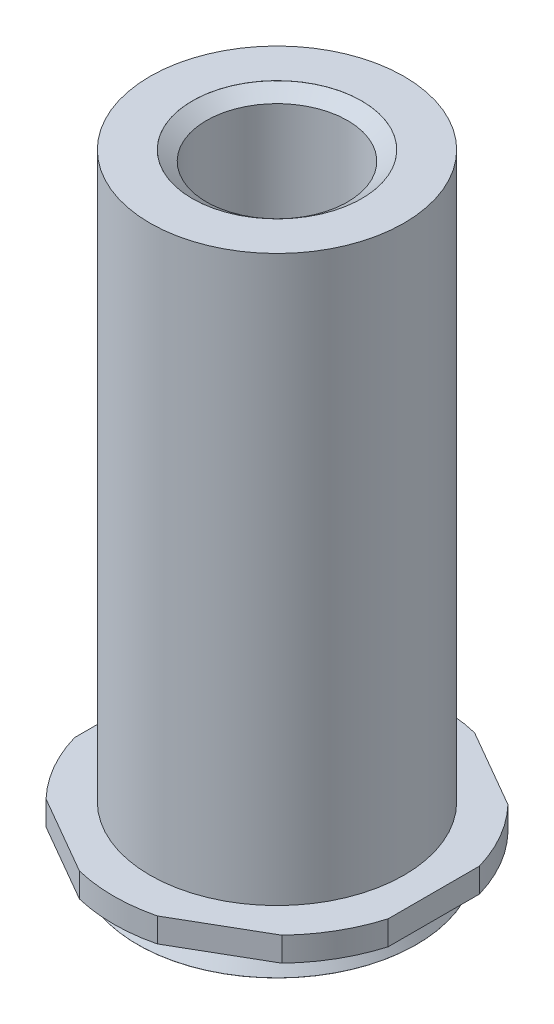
ISO-10303-21;
HEADER;
FILE_DESCRIPTION(('STEP AP214'),'2;1');
FILE_NAME('part.step','',(''),(''),'','','');
FILE_SCHEMA(('AUTOMOTIVE_DESIGN { 1 0 10303 214 1 1 1 1 }'));
ENDSEC;
DATA;
#1=APPLICATION_CONTEXT('core data for automotive mechanical design processes');
#2=APPLICATION_PROTOCOL_DEFINITION('international standard','automotive_design',2000,#1);
#3=PRODUCT_CONTEXT('',#1,'mechanical');
#4=PRODUCT('Part','Part','',(#3));
#5=PRODUCT_RELATED_PRODUCT_CATEGORY('part','',(#4));
#6=PRODUCT_DEFINITION_FORMATION('','',#4);
#7=PRODUCT_DEFINITION_CONTEXT('part definition',#1,'design');
#8=PRODUCT_DEFINITION('design','',#6,#7);
#9=PRODUCT_DEFINITION_SHAPE('','',#8);
#10=(LENGTH_UNIT() NAMED_UNIT(*) SI_UNIT(.MILLI.,.METRE.));
#11=(NAMED_UNIT(*) PLANE_ANGLE_UNIT() SI_UNIT($,.RADIAN.));
#12=(NAMED_UNIT(*) SI_UNIT($,.STERADIAN.) SOLID_ANGLE_UNIT());
#13=UNCERTAINTY_MEASURE_WITH_UNIT(LENGTH_MEASURE(1.E-05),#10,'distance_accuracy_value','');
#14=(GEOMETRIC_REPRESENTATION_CONTEXT(3) GLOBAL_UNCERTAINTY_ASSIGNED_CONTEXT((#13)) GLOBAL_UNIT_ASSIGNED_CONTEXT((#10,
#11,#12)) REPRESENTATION_CONTEXT('',''));
#15=CARTESIAN_POINT('',(0.,0.,0.));
#16=DIRECTION('',(0.,0.,1.));
#17=DIRECTION('',(1.,0.,0.));
#18=AXIS2_PLACEMENT_3D('',#15,#16,#17);
#19=CARTESIAN_POINT('',(0.,0.,0.));
#20=DIRECTION('',(0.,-1.,0.));
#21=DIRECTION('',(0.,0.,-1.));
#22=AXIS2_PLACEMENT_3D('',#19,#20,#21);
#23=CYLINDRICAL_SURFACE('',#22,5.785104);
#24=CARTESIAN_POINT('',(0.,0.,0.));
#25=DIRECTION('',(0.,-1.,0.));
#26=DIRECTION('',(0.,0.,-1.));
#27=AXIS2_PLACEMENT_3D('',#24,#25,#26);
#28=CIRCLE('',#27,5.785104);
#29=CARTESIAN_POINT('',(1.37855308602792,0.,5.61845349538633));
#30=VERTEX_POINT('',#29);
#31=CARTESIAN_POINT('',(-1.37855308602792,0.,5.61845349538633));
#32=VERTEX_POINT('',#31);
#33=EDGE_CURVE('E203',#30,#32,#28,.T.);
#34=ORIENTED_EDGE('',*,*,#33,.F.);
#35=DIRECTION('',(0.,-1.,0.));
#36=VECTOR('',#35,1.);
#37=CARTESIAN_POINT('',(1.37855308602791,0.,5.61845349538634));
#38=LINE('',#37,#36);
#39=CARTESIAN_POINT('',(1.37855308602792,0.859499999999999,5.61845349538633));
#40=VERTEX_POINT('',#39);
#41=EDGE_CURVE('E202',#30,#40,#38,.F.);
#42=ORIENTED_EDGE('',*,*,#41,.T.);
#43=CARTESIAN_POINT('',(0.,0.8595,0.));
#44=DIRECTION('',(0.,-1.,0.));
#45=DIRECTION('',(0.,0.,-1.));
#46=AXIS2_PLACEMENT_3D('',#43,#44,#45);
#47=CIRCLE('',#46,5.785104);
#48=CARTESIAN_POINT('',(-1.37855308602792,0.8595,5.61845349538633));
#49=VERTEX_POINT('',#48);
#50=EDGE_CURVE('E149',#40,#49,#47,.T.);
#51=ORIENTED_EDGE('',*,*,#50,.T.);
#52=DIRECTION('',(0.,-1.,0.));
#53=VECTOR('',#52,1.);
#54=CARTESIAN_POINT('',(-1.37855308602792,0.,5.61845349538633));
#55=LINE('',#54,#53);
#56=EDGE_CURVE('E200',#49,#32,#55,.T.);
#57=ORIENTED_EDGE('',*,*,#56,.T.);
#58=EDGE_LOOP('',(#34,#42,#51,#57));
#59=FACE_BOUND('',#58,.T.);
#60=ADVANCED_FACE('F32',(#59),#23,.T.);
#61=CARTESIAN_POINT('',(5.555,0.859499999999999,1.61536475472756));
#62=VERTEX_POINT('',#61);
#63=CARTESIAN_POINT('',(4.17644691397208,0.8595,4.00308874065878));
#64=VERTEX_POINT('',#63);
#65=EDGE_CURVE('E141',#62,#64,#47,.T.);
#66=ORIENTED_EDGE('',*,*,#65,.T.);
#67=DIRECTION('',(0.,-1.,0.));
#68=VECTOR('',#67,1.);
#69=CARTESIAN_POINT('',(4.17644691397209,0.,4.00308874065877));
#70=LINE('',#69,#68);
#71=CARTESIAN_POINT('',(4.17644691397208,0.,4.00308874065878));
#72=VERTEX_POINT('',#71);
#73=EDGE_CURVE('E207',#64,#72,#70,.T.);
#74=ORIENTED_EDGE('',*,*,#73,.T.);
#75=CARTESIAN_POINT('',(5.555,0.,1.61536475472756));
#76=VERTEX_POINT('',#75);
#77=EDGE_CURVE('E143',#76,#72,#28,.T.);
#78=ORIENTED_EDGE('',*,*,#77,.F.);
#79=DIRECTION('',(0.,-1.,0.));
#80=VECTOR('',#79,1.);
#81=CARTESIAN_POINT('',(5.555,0.,1.61536475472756));
#82=LINE('',#81,#80);
#83=EDGE_CURVE('E125',#76,#62,#82,.F.);
#84=ORIENTED_EDGE('',*,*,#83,.T.);
#85=EDGE_LOOP('',(#66,#74,#78,#84));
#86=FACE_BOUND('',#85,.T.);
#87=ADVANCED_FACE('F139',(#86),#23,.T.);
#88=CARTESIAN_POINT('',(-4.17644691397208,0.,4.00308874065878));
#89=VERTEX_POINT('',#88);
#90=CARTESIAN_POINT('',(-5.555,0.,1.61536475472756));
#91=VERTEX_POINT('',#90);
#92=EDGE_CURVE('E261',#89,#91,#28,.T.);
#93=ORIENTED_EDGE('',*,*,#92,.F.);
#94=DIRECTION('',(0.,-1.,0.));
#95=VECTOR('',#94,1.);
#96=CARTESIAN_POINT('',(-4.17644691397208,0.,4.00308874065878));
#97=LINE('',#96,#95);
#98=CARTESIAN_POINT('',(-4.17644691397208,0.859499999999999,4.00308874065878));
#99=VERTEX_POINT('',#98);
#100=EDGE_CURVE('E211',#89,#99,#97,.F.);
#101=ORIENTED_EDGE('',*,*,#100,.T.);
#102=CARTESIAN_POINT('',(-5.555,0.8595,1.61536475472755));
#103=VERTEX_POINT('',#102);
#104=EDGE_CURVE('E154',#99,#103,#47,.T.);
#105=ORIENTED_EDGE('',*,*,#104,.T.);
#106=DIRECTION('',(0.,-1.,0.));
#107=VECTOR('',#106,1.);
#108=CARTESIAN_POINT('',(-5.555,0.,1.61536475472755));
#109=LINE('',#108,#107);
#110=EDGE_CURVE('E54',#103,#91,#109,.T.);
#111=ORIENTED_EDGE('',*,*,#110,.T.);
#112=EDGE_LOOP('',(#93,#101,#105,#111));
#113=FACE_BOUND('',#112,.T.);
#114=ADVANCED_FACE('F243',(#113),#23,.T.);
#115=CARTESIAN_POINT('',(-5.555,0.,-1.61536475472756));
#116=VERTEX_POINT('',#115);
#117=CARTESIAN_POINT('',(-4.17644691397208,0.,-4.00308874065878));
#118=VERTEX_POINT('',#117);
#119=EDGE_CURVE('E181',#116,#118,#28,.T.);
#120=ORIENTED_EDGE('',*,*,#119,.F.);
#121=DIRECTION('',(0.,-1.,0.));
#122=VECTOR('',#121,1.);
#123=CARTESIAN_POINT('',(-5.555,0.,-1.61536475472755));
#124=LINE('',#123,#122);
#125=CARTESIAN_POINT('',(-5.555,0.859499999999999,-1.61536475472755));
#126=VERTEX_POINT('',#125);
#127=EDGE_CURVE('E275',#116,#126,#124,.F.);
#128=ORIENTED_EDGE('',*,*,#127,.T.);
#129=CARTESIAN_POINT('',(-4.17644691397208,0.8595,-4.00308874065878));
#130=VERTEX_POINT('',#129);
#131=EDGE_CURVE('E158',#126,#130,#47,.T.);
#132=ORIENTED_EDGE('',*,*,#131,.T.);
#133=DIRECTION('',(0.,-1.,0.));
#134=VECTOR('',#133,1.);
#135=CARTESIAN_POINT('',(-4.17644691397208,0.,-4.00308874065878));
#136=LINE('',#135,#134);
#137=EDGE_CURVE('E46',#130,#118,#136,.T.);
#138=ORIENTED_EDGE('',*,*,#137,.T.);
#139=EDGE_LOOP('',(#120,#128,#132,#138));
#140=FACE_BOUND('',#139,.T.);
#141=ADVANCED_FACE('F253',(#140),#23,.T.);
#142=CARTESIAN_POINT('',(-1.37855308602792,0.,-5.61845349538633));
#143=VERTEX_POINT('',#142);
#144=CARTESIAN_POINT('',(1.37855308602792,0.,-5.61845349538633));
#145=VERTEX_POINT('',#144);
#146=EDGE_CURVE('E178',#143,#145,#28,.T.);
#147=ORIENTED_EDGE('',*,*,#146,.F.);
#148=DIRECTION('',(0.,-1.,0.));
#149=VECTOR('',#148,1.);
#150=CARTESIAN_POINT('',(-1.37855308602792,0.,-5.61845349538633));
#151=LINE('',#150,#149);
#152=CARTESIAN_POINT('',(-1.37855308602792,0.859499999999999,-5.61845349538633));
#153=VERTEX_POINT('',#152);
#154=EDGE_CURVE('E277',#143,#153,#151,.F.);
#155=ORIENTED_EDGE('',*,*,#154,.T.);
#156=CARTESIAN_POINT('',(1.37855308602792,0.8595,-5.61845349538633));
#157=VERTEX_POINT('',#156);
#158=EDGE_CURVE('E152',#153,#157,#47,.T.);
#159=ORIENTED_EDGE('',*,*,#158,.T.);
#160=DIRECTION('',(0.,-1.,0.));
#161=VECTOR('',#160,1.);
#162=CARTESIAN_POINT('',(1.37855308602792,0.,-5.61845349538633));
#163=LINE('',#162,#161);
#164=EDGE_CURVE('E144',#157,#145,#163,.T.);
#165=ORIENTED_EDGE('',*,*,#164,.T.);
#166=EDGE_LOOP('',(#147,#155,#159,#165));
#167=FACE_BOUND('',#166,.T.);
#168=ADVANCED_FACE('F246',(#167),#23,.T.);
#169=CARTESIAN_POINT('',(4.17644691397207,0.,-4.00308874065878));
#170=VERTEX_POINT('',#169);
#171=CARTESIAN_POINT('',(5.555,0.,-1.61536475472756));
#172=VERTEX_POINT('',#171);
#173=EDGE_CURVE('E134',#170,#172,#28,.T.);
#174=ORIENTED_EDGE('',*,*,#173,.F.);
#175=DIRECTION('',(0.,-1.,0.));
#176=VECTOR('',#175,1.);
#177=CARTESIAN_POINT('',(4.17644691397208,0.,-4.00308874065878));
#178=LINE('',#177,#176);
#179=CARTESIAN_POINT('',(4.17644691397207,0.859499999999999,-4.00308874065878));
#180=VERTEX_POINT('',#179);
#181=EDGE_CURVE('E258',#170,#180,#178,.F.);
#182=ORIENTED_EDGE('',*,*,#181,.T.);
#183=CARTESIAN_POINT('',(5.555,0.8595,-1.61536475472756));
#184=VERTEX_POINT('',#183);
#185=EDGE_CURVE('E148',#180,#184,#47,.T.);
#186=ORIENTED_EDGE('',*,*,#185,.T.);
#187=DIRECTION('',(0.,-1.,0.));
#188=VECTOR('',#187,1.);
#189=CARTESIAN_POINT('',(5.555,0.,-1.61536475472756));
#190=LINE('',#189,#188);
#191=EDGE_CURVE('E128',#184,#172,#190,.T.);
#192=ORIENTED_EDGE('',*,*,#191,.T.);
#193=EDGE_LOOP('',(#174,#182,#186,#192));
#194=FACE_BOUND('',#193,.T.);
#195=ADVANCED_FACE('F239',(#194),#23,.T.);
#196=CARTESIAN_POINT('',(4.50063644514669,0.,0.));
#197=DIRECTION('',(0.,-1.,0.));
#198=DIRECTION('',(0.,0.,-1.));
#199=AXIS2_PLACEMENT_3D('',#196,#197,#198);
#200=PLANE('',#199);
#201=CARTESIAN_POINT('',(0.,0.,0.));
#202=DIRECTION('',(0.,-1.,0.));
#203=DIRECTION('',(0.,0.,-1.));
#204=AXIS2_PLACEMENT_3D('',#201,#202,#203);
#205=CIRCLE('',#204,4.50063644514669);
#206=CARTESIAN_POINT('',(0.,0.,-4.50063644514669));
#207=VERTEX_POINT('',#206);
#208=EDGE_CURVE('E175',#207,#207,#205,.T.);
#209=ORIENTED_EDGE('',*,*,#208,.F.);
#210=EDGE_LOOP('',(#209));
#211=FACE_BOUND('',#210,.T.);
#212=ORIENTED_EDGE('',*,*,#77,.T.);
#213=DIRECTION('',(0.866025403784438,0.,-0.5));
#214=VECTOR('',#213,1.);
#215=CARTESIAN_POINT('',(5.555,0.,3.20718074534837));
#216=LINE('',#215,#214);
#217=EDGE_CURVE('E299',#30,#72,#216,.T.);
#218=ORIENTED_EDGE('',*,*,#217,.F.);
#219=ORIENTED_EDGE('',*,*,#33,.T.);
#220=DIRECTION('',(0.866025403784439,0.,0.5));
#221=VECTOR('',#220,1.);
#222=CARTESIAN_POINT('',(0.,0.,6.41436149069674));
#223=LINE('',#222,#221);
#224=EDGE_CURVE('E288',#89,#32,#223,.T.);
#225=ORIENTED_EDGE('',*,*,#224,.F.);
#226=ORIENTED_EDGE('',*,*,#92,.T.);
#227=DIRECTION('',(0.,0.,1.));
#228=VECTOR('',#227,1.);
#229=CARTESIAN_POINT('',(-5.555,0.,3.20718074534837));
#230=LINE('',#229,#228);
#231=EDGE_CURVE('E271',#116,#91,#230,.T.);
#232=ORIENTED_EDGE('',*,*,#231,.F.);
#233=ORIENTED_EDGE('',*,*,#119,.T.);
#234=DIRECTION('',(-0.866025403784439,0.,0.5));
#235=VECTOR('',#234,1.);
#236=CARTESIAN_POINT('',(-5.555,0.,-3.20718074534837));
#237=LINE('',#236,#235);
#238=EDGE_CURVE('E269',#143,#118,#237,.T.);
#239=ORIENTED_EDGE('',*,*,#238,.F.);
#240=ORIENTED_EDGE('',*,*,#146,.T.);
#241=DIRECTION('',(-0.866025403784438,0.,-0.5));
#242=VECTOR('',#241,1.);
#243=CARTESIAN_POINT('',(0.,0.,-6.41436149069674));
#244=LINE('',#243,#242);
#245=EDGE_CURVE('E296',#170,#145,#244,.T.);
#246=ORIENTED_EDGE('',*,*,#245,.F.);
#247=ORIENTED_EDGE('',*,*,#173,.T.);
#248=DIRECTION('',(0.,0.,-1.));
#249=VECTOR('',#248,1.);
#250=CARTESIAN_POINT('',(5.555,0.,-3.20718074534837));
#251=LINE('',#250,#249);
#252=EDGE_CURVE('E297',#76,#172,#251,.T.);
#253=ORIENTED_EDGE('',*,*,#252,.F.);
#254=EDGE_LOOP('',(#212,#218,#219,#225,#226,#232,#233,#239,#240,#246,#247,#253));
#255=FACE_BOUND('',#254,.T.);
#256=ADVANCED_FACE('F245',(#211,#255),#200,.T.);
#257=CARTESIAN_POINT('',(5.785104,0.859499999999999,0.));
#258=DIRECTION('',(0.,1.,0.));
#259=DIRECTION('',(0.,0.,1.));
#260=AXIS2_PLACEMENT_3D('',#257,#258,#259);
#261=PLANE('',#260);
#262=CARTESIAN_POINT('',(0.,0.859499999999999,0.));
#263=DIRECTION('',(0.,-1.,0.));
#264=DIRECTION('',(0.,0.,-1.));
#265=AXIS2_PLACEMENT_3D('',#262,#263,#264);
#266=CIRCLE('',#265,4.5);
#267=CARTESIAN_POINT('',(0.,0.859499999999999,-4.5));
#268=VERTEX_POINT('',#267);
#269=EDGE_CURVE('E151',#268,#268,#266,.T.);
#270=ORIENTED_EDGE('',*,*,#269,.T.);
#271=EDGE_LOOP('',(#270));
#272=FACE_BOUND('',#271,.T.);
#273=ORIENTED_EDGE('',*,*,#50,.F.);
#274=DIRECTION('',(0.866025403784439,0.,-0.5));
#275=VECTOR('',#274,1.);
#276=CARTESIAN_POINT('',(7.116328,0.859499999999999,2.30574760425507));
#277=LINE('',#276,#275);
#278=EDGE_CURVE('E11',#40,#64,#277,.T.);
#279=ORIENTED_EDGE('',*,*,#278,.T.);
#280=ORIENTED_EDGE('',*,*,#65,.F.);
#281=DIRECTION('',(0.,0.,-1.));
#282=VECTOR('',#281,1.);
#283=CARTESIAN_POINT('',(5.555,0.859499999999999,0.));
#284=LINE('',#283,#282);
#285=EDGE_CURVE('E122',#62,#184,#284,.T.);
#286=ORIENTED_EDGE('',*,*,#285,.T.);
#287=ORIENTED_EDGE('',*,*,#185,.F.);
#288=DIRECTION('',(-0.866025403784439,0.,-0.5));
#289=VECTOR('',#288,1.);
#290=CARTESIAN_POINT('',(7.116328,0.859499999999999,-2.30574760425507));
#291=LINE('',#290,#289);
#292=EDGE_CURVE('E133',#180,#157,#291,.T.);
#293=ORIENTED_EDGE('',*,*,#292,.T.);
#294=ORIENTED_EDGE('',*,*,#158,.F.);
#295=DIRECTION('',(-0.866025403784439,0.,0.5));
#296=VECTOR('',#295,1.);
#297=CARTESIAN_POINT('',(1.561328,0.859499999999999,-7.31579463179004));
#298=LINE('',#297,#296);
#299=EDGE_CURVE('E188',#153,#130,#298,.T.);
#300=ORIENTED_EDGE('',*,*,#299,.T.);
#301=ORIENTED_EDGE('',*,*,#131,.F.);
#302=DIRECTION('',(0.,0.,1.));
#303=VECTOR('',#302,1.);
#304=CARTESIAN_POINT('',(-5.555,0.859499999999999,0.));
#305=LINE('',#304,#303);
#306=EDGE_CURVE('E190',#126,#103,#305,.T.);
#307=ORIENTED_EDGE('',*,*,#306,.T.);
#308=ORIENTED_EDGE('',*,*,#104,.F.);
#309=DIRECTION('',(0.866025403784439,0.,0.5));
#310=VECTOR('',#309,1.);
#311=CARTESIAN_POINT('',(1.561328,0.859499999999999,7.31579463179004));
#312=LINE('',#311,#310);
#313=EDGE_CURVE('E39',#99,#49,#312,.T.);
#314=ORIENTED_EDGE('',*,*,#313,.T.);
#315=EDGE_LOOP('',(#273,#279,#280,#286,#287,#293,#294,#300,#301,#307,#308,#314));
#316=FACE_BOUND('',#315,.T.);
#317=ADVANCED_FACE('F147',(#272,#316),#261,.T.);
#318=CARTESIAN_POINT('',(0.,0.,0.));
#319=DIRECTION('',(0.,-1.,0.));
#320=DIRECTION('',(0.,0.,-1.));
#321=AXIS2_PLACEMENT_3D('',#318,#319,#320);
#322=CYLINDRICAL_SURFACE('',#321,4.50063644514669);
#323=ORIENTED_EDGE('',*,*,#208,.T.);
#324=EDGE_LOOP('',(#323));
#325=FACE_BOUND('',#324,.T.);
#326=CARTESIAN_POINT('',(0.,-0.2865,0.));
#327=DIRECTION('',(0.,-1.,0.));
#328=DIRECTION('',(0.,0.,-1.));
#329=AXIS2_PLACEMENT_3D('',#326,#327,#328);
#330=CIRCLE('',#329,4.50063644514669);
#331=CARTESIAN_POINT('',(0.,-0.2865,-4.50063644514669));
#332=VERTEX_POINT('',#331);
#333=EDGE_CURVE('E172',#332,#332,#330,.T.);
#334=ORIENTED_EDGE('',*,*,#333,.F.);
#335=EDGE_LOOP('',(#334));
#336=FACE_BOUND('',#335,.T.);
#337=ADVANCED_FACE('F334',(#325,#336),#322,.T.);
#338=CARTESIAN_POINT('',(0.,-1.0475,0.));
#339=DIRECTION('',(0.,-1.,0.));
#340=DIRECTION('',(0.,0.,-1.));
#341=AXIS2_PLACEMENT_3D('',#338,#339,#340);
#342=CONICAL_SURFACE('',#341,4.94,0.523598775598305);
#343=ORIENTED_EDGE('',*,*,#333,.T.);
#344=EDGE_LOOP('',(#343));
#345=FACE_BOUND('',#344,.T.);
#346=CARTESIAN_POINT('',(0.,-1.0475,0.));
#347=DIRECTION('',(0.,-1.,0.));
#348=DIRECTION('',(0.,0.,-1.));
#349=AXIS2_PLACEMENT_3D('',#346,#347,#348);
#350=CIRCLE('',#349,4.94);
#351=CARTESIAN_POINT('',(0.,-1.0475,-4.94));
#352=VERTEX_POINT('',#351);
#353=EDGE_CURVE('E169',#352,#352,#350,.T.);
#354=ORIENTED_EDGE('',*,*,#353,.F.);
#355=EDGE_LOOP('',(#354));
#356=FACE_BOUND('',#355,.T.);
#357=ADVANCED_FACE('F338',(#345,#356),#342,.T.);
#358=CARTESIAN_POINT('',(0.,0.,0.));
#359=DIRECTION('',(0.,-1.,0.));
#360=DIRECTION('',(0.,0.,-1.));
#361=AXIS2_PLACEMENT_3D('',#358,#359,#360);
#362=CYLINDRICAL_SURFACE('',#361,4.94);
#363=ORIENTED_EDGE('',*,*,#353,.T.);
#364=EDGE_LOOP('',(#363));
#365=FACE_BOUND('',#364,.T.);
#366=CARTESIAN_POINT('',(0.,-1.0505,0.));
#367=DIRECTION('',(0.,-1.,0.));
#368=DIRECTION('',(0.,0.,-1.));
#369=AXIS2_PLACEMENT_3D('',#366,#367,#368);
#370=CIRCLE('',#369,4.94);
#371=CARTESIAN_POINT('',(0.,-1.0505,-4.94));
#372=VERTEX_POINT('',#371);
#373=EDGE_CURVE('E166',#372,#372,#370,.T.);
#374=ORIENTED_EDGE('',*,*,#373,.F.);
#375=EDGE_LOOP('',(#374));
#376=FACE_BOUND('',#375,.T.);
#377=ADVANCED_FACE('F344',(#365,#376),#362,.T.);
#378=CARTESIAN_POINT('',(0.,-1.0505,0.));
#379=DIRECTION('',(0.,-1.,0.));
#380=DIRECTION('',(0.,0.,-1.));
#381=AXIS2_PLACEMENT_3D('',#378,#379,#380);
#382=PLANE('',#381);
#383=ORIENTED_EDGE('',*,*,#373,.T.);
#384=EDGE_LOOP('',(#383));
#385=FACE_BOUND('',#384,.T.);
#386=ADVANCED_FACE('F327',(#385),#382,.T.);
#387=CARTESIAN_POINT('',(4.5,20.8595,0.));
#388=DIRECTION('',(0.,1.,0.));
#389=DIRECTION('',(0.,0.,1.));
#390=AXIS2_PLACEMENT_3D('',#387,#388,#389);
#391=PLANE('',#390);
#392=CARTESIAN_POINT('',(0.,20.8595,0.));
#393=DIRECTION('',(0.,1.,0.));
#394=DIRECTION('',(0.,0.,1.));
#395=AXIS2_PLACEMENT_3D('',#392,#393,#394);
#396=CIRCLE('',#395,3.);
#397=CARTESIAN_POINT('',(0.,20.8595,3.));
#398=VERTEX_POINT('',#397);
#399=EDGE_CURVE('E182',#398,#398,#396,.T.);
#400=ORIENTED_EDGE('',*,*,#399,.F.);
#401=EDGE_LOOP('',(#400));
#402=FACE_BOUND('',#401,.T.);
#403=CARTESIAN_POINT('',(0.,20.8595,0.));
#404=DIRECTION('',(0.,-1.,0.));
#405=DIRECTION('',(0.,0.,-1.));
#406=AXIS2_PLACEMENT_3D('',#403,#404,#405);
#407=CIRCLE('',#406,4.5);
#408=CARTESIAN_POINT('',(0.,20.8595,-4.5));
#409=VERTEX_POINT('',#408);
#410=EDGE_CURVE('E163',#409,#409,#407,.T.);
#411=ORIENTED_EDGE('',*,*,#410,.F.);
#412=EDGE_LOOP('',(#411));
#413=FACE_BOUND('',#412,.T.);
#414=ADVANCED_FACE('F318',(#402,#413),#391,.T.);
#415=CARTESIAN_POINT('',(0.,0.,0.));
#416=DIRECTION('',(0.,-1.,0.));
#417=DIRECTION('',(0.,0.,-1.));
#418=AXIS2_PLACEMENT_3D('',#415,#416,#417);
#419=CYLINDRICAL_SURFACE('',#418,4.5);
#420=ORIENTED_EDGE('',*,*,#410,.T.);
#421=EDGE_LOOP('',(#420));
#422=FACE_BOUND('',#421,.T.);
#423=ORIENTED_EDGE('',*,*,#269,.F.);
#424=EDGE_LOOP('',(#423));
#425=FACE_BOUND('',#424,.T.);
#426=ADVANCED_FACE('F313',(#422,#425),#419,.T.);
#427=CARTESIAN_POINT('',(0.,-2.54,0.));
#428=DIRECTION('',(0.,-1.,0.));
#429=DIRECTION('',(0.,0.,-1.));
#430=AXIS2_PLACEMENT_3D('',#427,#428,#429);
#431=CYLINDRICAL_SURFACE('',#430,3.);
#432=ORIENTED_EDGE('',*,*,#399,.T.);
#433=EDGE_LOOP('',(#432));
#434=FACE_BOUND('',#433,.T.);
#435=CARTESIAN_POINT('',(0.,20.85696,0.));
#436=DIRECTION('',(0.,-1.,0.));
#437=DIRECTION('',(0.,0.,-1.));
#438=AXIS2_PLACEMENT_3D('',#435,#436,#437);
#439=CIRCLE('',#438,3.);
#440=CARTESIAN_POINT('',(0.,20.85696,-3.));
#441=VERTEX_POINT('',#440);
#442=EDGE_CURVE('E206',#441,#441,#439,.T.);
#443=ORIENTED_EDGE('',*,*,#442,.T.);
#444=EDGE_LOOP('',(#443));
#445=FACE_BOUND('',#444,.T.);
#446=ADVANCED_FACE('F233',(#434,#445),#431,.F.);
#447=CARTESIAN_POINT('',(0.,20.5069862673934,0.));
#448=DIRECTION('',(0.,1.,0.));
#449=DIRECTION('',(0.,0.,1.));
#450=AXIS2_PLACEMENT_3D('',#447,#448,#449);
#451=CONICAL_SURFACE('',#450,2.5,0.960105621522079);
#452=ORIENTED_EDGE('',*,*,#442,.F.);
#453=EDGE_LOOP('',(#452));
#454=FACE_BOUND('',#453,.T.);
#455=CARTESIAN_POINT('',(0.,20.5069862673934,0.));
#456=DIRECTION('',(0.,-1.,0.));
#457=DIRECTION('',(0.,0.,-1.));
#458=AXIS2_PLACEMENT_3D('',#455,#456,#457);
#459=CIRCLE('',#458,2.5);
#460=CARTESIAN_POINT('',(0.,20.5069862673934,-2.5));
#461=VERTEX_POINT('',#460);
#462=EDGE_CURVE('E184',#461,#461,#459,.T.);
#463=ORIENTED_EDGE('',*,*,#462,.T.);
#464=EDGE_LOOP('',(#463));
#465=FACE_BOUND('',#464,.T.);
#466=ADVANCED_FACE('F217',(#454,#465),#451,.F.);
#467=CARTESIAN_POINT('',(0.,5.22396609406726,0.));
#468=DIRECTION('',(0.,1.,0.));
#469=DIRECTION('',(0.,0.,1.));
#470=AXIS2_PLACEMENT_3D('',#467,#468,#469);
#471=CONICAL_SURFACE('',#470,0.,1.17809724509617);
#472=CARTESIAN_POINT('',(0.,6.2595,0.));
#473=DIRECTION('',(0.,-1.,0.));
#474=DIRECTION('',(0.,0.,-1.));
#475=AXIS2_PLACEMENT_3D('',#472,#473,#474);
#476=CIRCLE('',#475,2.5);
#477=CARTESIAN_POINT('',(0.,6.2595,-2.5));
#478=VERTEX_POINT('',#477);
#479=EDGE_CURVE('E159',#478,#478,#476,.T.);
#480=ORIENTED_EDGE('',*,*,#479,.F.);
#481=EDGE_LOOP('',(#480));
#482=FACE_BOUND('',#481,.T.);
#483=CARTESIAN_POINT('',(0.,5.22396609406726,0.));
#484=VERTEX_POINT('',#483);
#485=VERTEX_LOOP('',#484);
#486=FACE_BOUND('',#485,.T.);
#487=ADVANCED_FACE('F222',(#482,#486),#471,.F.);
#488=CARTESIAN_POINT('',(0.,0.,0.));
#489=DIRECTION('',(0.,-1.,0.));
#490=DIRECTION('',(0.,0.,-1.));
#491=AXIS2_PLACEMENT_3D('',#488,#489,#490);
#492=CYLINDRICAL_SURFACE('',#491,2.5);
#493=ORIENTED_EDGE('',*,*,#462,.F.);
#494=EDGE_LOOP('',(#493));
#495=FACE_BOUND('',#494,.T.);
#496=ORIENTED_EDGE('',*,*,#479,.T.);
#497=EDGE_LOOP('',(#496));
#498=FACE_BOUND('',#497,.T.);
#499=ADVANCED_FACE('F219',(#495,#498),#492,.F.);
#500=CARTESIAN_POINT('',(5.555,0.,-3.20718074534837));
#501=DIRECTION('',(1.,0.,0.));
#502=DIRECTION('',(0.,0.,-1.));
#503=AXIS2_PLACEMENT_3D('',#500,#501,#502);
#504=PLANE('',#503);
#505=ORIENTED_EDGE('',*,*,#252,.T.);
#506=ORIENTED_EDGE('',*,*,#191,.F.);
#507=ORIENTED_EDGE('',*,*,#285,.F.);
#508=ORIENTED_EDGE('',*,*,#83,.F.);
#509=EDGE_LOOP('',(#505,#506,#507,#508));
#510=FACE_BOUND('',#509,.T.);
#511=ADVANCED_FACE('F124',(#510),#504,.T.);
#512=CARTESIAN_POINT('',(0.,0.,-6.41436149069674));
#513=DIRECTION('',(0.5,0.,-0.866025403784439));
#514=DIRECTION('',(-0.866025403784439,0.,-0.5));
#515=AXIS2_PLACEMENT_3D('',#512,#513,#514);
#516=PLANE('',#515);
#517=ORIENTED_EDGE('',*,*,#245,.T.);
#518=ORIENTED_EDGE('',*,*,#164,.F.);
#519=ORIENTED_EDGE('',*,*,#292,.F.);
#520=ORIENTED_EDGE('',*,*,#181,.F.);
#521=EDGE_LOOP('',(#517,#518,#519,#520));
#522=FACE_BOUND('',#521,.T.);
#523=ADVANCED_FACE('F444',(#522),#516,.T.);
#524=CARTESIAN_POINT('',(-5.555,0.,-3.20718074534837));
#525=DIRECTION('',(-0.5,0.,-0.866025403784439));
#526=DIRECTION('',(-0.866025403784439,0.,0.5));
#527=AXIS2_PLACEMENT_3D('',#524,#525,#526);
#528=PLANE('',#527);
#529=ORIENTED_EDGE('',*,*,#238,.T.);
#530=ORIENTED_EDGE('',*,*,#137,.F.);
#531=ORIENTED_EDGE('',*,*,#299,.F.);
#532=ORIENTED_EDGE('',*,*,#154,.F.);
#533=EDGE_LOOP('',(#529,#530,#531,#532));
#534=FACE_BOUND('',#533,.T.);
#535=ADVANCED_FACE('F451',(#534),#528,.T.);
#536=CARTESIAN_POINT('',(-5.555,0.,3.20718074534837));
#537=DIRECTION('',(-1.,0.,0.));
#538=DIRECTION('',(0.,0.,1.));
#539=AXIS2_PLACEMENT_3D('',#536,#537,#538);
#540=PLANE('',#539);
#541=ORIENTED_EDGE('',*,*,#231,.T.);
#542=ORIENTED_EDGE('',*,*,#110,.F.);
#543=ORIENTED_EDGE('',*,*,#306,.F.);
#544=ORIENTED_EDGE('',*,*,#127,.F.);
#545=EDGE_LOOP('',(#541,#542,#543,#544));
#546=FACE_BOUND('',#545,.T.);
#547=ADVANCED_FACE('F308',(#546),#540,.T.);
#548=CARTESIAN_POINT('',(0.,0.,6.41436149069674));
#549=DIRECTION('',(-0.5,0.,0.866025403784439));
#550=DIRECTION('',(0.866025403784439,0.,0.5));
#551=AXIS2_PLACEMENT_3D('',#548,#549,#550);
#552=PLANE('',#551);
#553=ORIENTED_EDGE('',*,*,#224,.T.);
#554=ORIENTED_EDGE('',*,*,#56,.F.);
#555=ORIENTED_EDGE('',*,*,#313,.F.);
#556=ORIENTED_EDGE('',*,*,#100,.F.);
#557=EDGE_LOOP('',(#553,#554,#555,#556));
#558=FACE_BOUND('',#557,.T.);
#559=ADVANCED_FACE('F287',(#558),#552,.T.);
#560=CARTESIAN_POINT('',(5.555,0.,3.20718074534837));
#561=DIRECTION('',(0.5,0.,0.866025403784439));
#562=DIRECTION('',(0.866025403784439,0.,-0.5));
#563=AXIS2_PLACEMENT_3D('',#560,#561,#562);
#564=PLANE('',#563);
#565=ORIENTED_EDGE('',*,*,#217,.T.);
#566=ORIENTED_EDGE('',*,*,#73,.F.);
#567=ORIENTED_EDGE('',*,*,#278,.F.);
#568=ORIENTED_EDGE('',*,*,#41,.F.);
#569=EDGE_LOOP('',(#565,#566,#567,#568));
#570=FACE_BOUND('',#569,.T.);
#571=ADVANCED_FACE('F302',(#570),#564,.T.);
#572=CLOSED_SHELL('',(#60,#87,#114,#141,#168,#195,#256,#317,#337,#357,#377,#386,#414,#426,#446,
#466,#487,#499,#511,#523,#535,#547,#559,#571));
#573=MANIFOLD_SOLID_BREP('B2',#572);
#574=ADVANCED_BREP_SHAPE_REPRESENTATION('',(#18,#573),#14);
#575=SHAPE_DEFINITION_REPRESENTATION(#9,#574);
ENDSEC;
END-ISO-10303-21;
